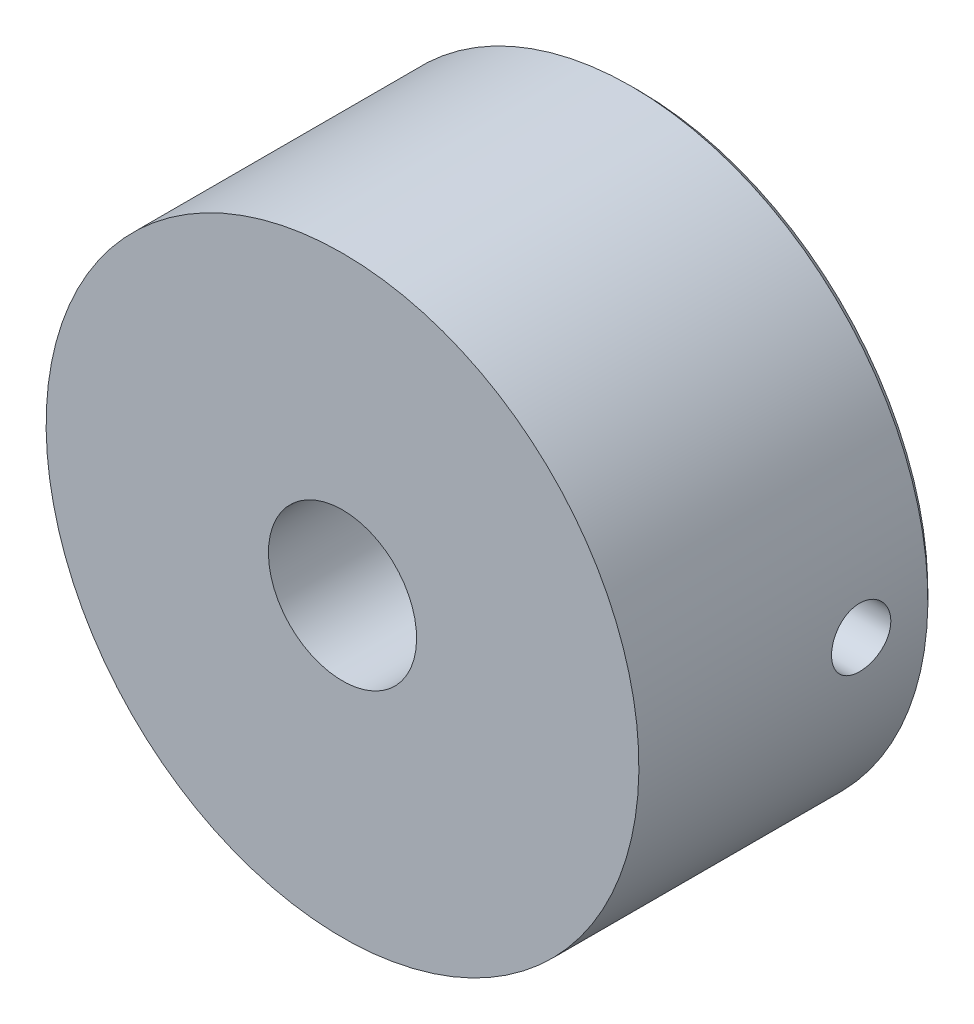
ISO-10303-21;
HEADER;
FILE_DESCRIPTION(('STEP AP214'),'2;1');
FILE_NAME('part.step','',(''),(''),'','','');
FILE_SCHEMA(('AUTOMOTIVE_DESIGN { 1 0 10303 214 1 1 1 1 }'));
ENDSEC;
DATA;
#1=APPLICATION_CONTEXT('core data for automotive mechanical design processes');
#2=APPLICATION_PROTOCOL_DEFINITION('international standard','automotive_design',2000,#1);
#3=PRODUCT_CONTEXT('',#1,'mechanical');
#4=PRODUCT('Part','Part','',(#3));
#5=PRODUCT_RELATED_PRODUCT_CATEGORY('part','',(#4));
#6=PRODUCT_DEFINITION_FORMATION('','',#4);
#7=PRODUCT_DEFINITION_CONTEXT('part definition',#1,'design');
#8=PRODUCT_DEFINITION('design','',#6,#7);
#9=PRODUCT_DEFINITION_SHAPE('','',#8);
#10=(LENGTH_UNIT() NAMED_UNIT(*) SI_UNIT(.MILLI.,.METRE.));
#11=(NAMED_UNIT(*) PLANE_ANGLE_UNIT() SI_UNIT($,.RADIAN.));
#12=(NAMED_UNIT(*) SI_UNIT($,.STERADIAN.) SOLID_ANGLE_UNIT());
#13=UNCERTAINTY_MEASURE_WITH_UNIT(LENGTH_MEASURE(1.E-05),#10,'distance_accuracy_value','');
#14=(GEOMETRIC_REPRESENTATION_CONTEXT(3) GLOBAL_UNCERTAINTY_ASSIGNED_CONTEXT((#13)) GLOBAL_UNIT_ASSIGNED_CONTEXT((#10,
#11,#12)) REPRESENTATION_CONTEXT('',''));
#15=CARTESIAN_POINT('',(0.,0.,0.));
#16=DIRECTION('',(0.,0.,1.));
#17=DIRECTION('',(1.,0.,0.));
#18=AXIS2_PLACEMENT_3D('',#15,#16,#17);
#19=CARTESIAN_POINT('',(0.,0.,20.));
#20=DIRECTION('',(0.,0.,1.));
#21=DIRECTION('',(0.,1.,0.));
#22=AXIS2_PLACEMENT_3D('',#19,#20,#21);
#23=PLANE('',#22);
#24=CARTESIAN_POINT('',(0.,0.,20.));
#25=DIRECTION('',(0.,0.,1.));
#26=DIRECTION('',(0.,1.,0.));
#27=AXIS2_PLACEMENT_3D('',#24,#25,#26);
#28=CIRCLE('',#27,20.);
#29=CARTESIAN_POINT('',(0.,20.,20.));
#30=VERTEX_POINT('',#29);
#31=EDGE_CURVE('E23',#30,#30,#28,.T.);
#32=ORIENTED_EDGE('',*,*,#31,.T.);
#33=EDGE_LOOP('',(#32));
#34=FACE_BOUND('',#33,.T.);
#35=CARTESIAN_POINT('',(0.,0.,20.));
#36=DIRECTION('',(0.,0.,1.));
#37=DIRECTION('',(0.,1.,0.));
#38=AXIS2_PLACEMENT_3D('',#35,#36,#37);
#39=CIRCLE('',#38,5.);
#40=CARTESIAN_POINT('',(0.,5.,20.));
#41=VERTEX_POINT('',#40);
#42=EDGE_CURVE('E27',#41,#41,#39,.T.);
#43=ORIENTED_EDGE('',*,*,#42,.F.);
#44=EDGE_LOOP('',(#43));
#45=FACE_BOUND('',#44,.T.);
#46=ADVANCED_FACE('F12',(#34,#45),#23,.T.);
#47=CARTESIAN_POINT('',(0.,0.,0.));
#48=DIRECTION('',(0.,0.,1.));
#49=DIRECTION('',(0.,1.,0.));
#50=AXIS2_PLACEMENT_3D('',#47,#48,#49);
#51=PLANE('',#50);
#52=CARTESIAN_POINT('',(0.,0.,0.));
#53=DIRECTION('',(0.,0.,1.));
#54=DIRECTION('',(0.,1.,0.));
#55=AXIS2_PLACEMENT_3D('',#52,#53,#54);
#56=CIRCLE('',#55,19.5);
#57=CARTESIAN_POINT('',(0.,19.5,0.));
#58=VERTEX_POINT('',#57);
#59=EDGE_CURVE('E8',#58,#58,#56,.F.);
#60=ORIENTED_EDGE('',*,*,#59,.T.);
#61=EDGE_LOOP('',(#60));
#62=FACE_BOUND('',#61,.T.);
#63=CARTESIAN_POINT('',(0.,0.,0.));
#64=DIRECTION('',(0.,0.,1.));
#65=DIRECTION('',(0.,1.,0.));
#66=AXIS2_PLACEMENT_3D('',#63,#64,#65);
#67=CIRCLE('',#66,5.);
#68=CARTESIAN_POINT('',(0.,5.,0.));
#69=VERTEX_POINT('',#68);
#70=EDGE_CURVE('E32',#69,#69,#67,.T.);
#71=ORIENTED_EDGE('',*,*,#70,.T.);
#72=EDGE_LOOP('',(#71));
#73=FACE_BOUND('',#72,.T.);
#74=ADVANCED_FACE('F64',(#62,#73),#51,.F.);
#75=CARTESIAN_POINT('',(0.,0.,20.));
#76=DIRECTION('',(0.,0.,-1.));
#77=DIRECTION('',(0.,-1.,0.));
#78=AXIS2_PLACEMENT_3D('',#75,#76,#77);
#79=CYLINDRICAL_SURFACE('',#78,20.);
#80=CARTESIAN_POINT('',(20.,0.,7.));
#81=CARTESIAN_POINT('',(19.9999987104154,-0.112040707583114,6.99999514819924));
#82=CARTESIAN_POINT('',(19.9990485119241,-0.224155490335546,6.99055346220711));
#83=CARTESIAN_POINT('',(19.9953493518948,-0.445276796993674,6.95303125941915));
#84=CARTESIAN_POINT('',(19.9925984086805,-0.554279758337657,6.92493020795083));
#85=CARTESIAN_POINT('',(19.9856082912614,-0.765943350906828,6.85091551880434));
#86=CARTESIAN_POINT('',(19.9813700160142,-0.868607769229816,6.80501263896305));
#87=CARTESIAN_POINT('',(19.9718791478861,-1.06475232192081,6.69671818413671));
#88=CARTESIAN_POINT('',(19.9666267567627,-1.15823427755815,6.63432988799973));
#89=CARTESIAN_POINT('',(19.9556748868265,-1.33371910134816,6.49459460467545));
#90=CARTESIAN_POINT('',(19.9499740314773,-1.41568428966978,6.41720040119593));
#91=CARTESIAN_POINT('',(19.9387791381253,-1.56548504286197,6.24975093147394));
#92=CARTESIAN_POINT('',(19.9332851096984,-1.63331995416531,6.15969507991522));
#93=CARTESIAN_POINT('',(19.9231118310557,-1.75306794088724,5.96924293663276));
#94=CARTESIAN_POINT('',(19.9184343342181,-1.80494693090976,5.86882511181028));
#95=CARTESIAN_POINT('',(19.9104407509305,-1.89109276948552,5.66064882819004));
#96=CARTESIAN_POINT('',(19.9071246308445,-1.92536005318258,5.5528905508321));
#97=CARTESIAN_POINT('',(19.9022416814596,-1.97519808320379,5.33347639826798));
#98=CARTESIAN_POINT('',(19.9006690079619,-1.99083130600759,5.22183484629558));
#99=CARTESIAN_POINT('',(19.8994328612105,-2.00315057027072,4.99750227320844));
#100=CARTESIAN_POINT('',(19.8997693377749,-1.99983710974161,4.88481127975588));
#101=CARTESIAN_POINT('',(19.9023081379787,-1.97440856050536,4.66200938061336));
#102=CARTESIAN_POINT('',(19.904503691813,-1.95236168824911,4.55189060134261));
#103=CARTESIAN_POINT('',(19.9105026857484,-1.89019828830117,4.33692407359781));
#104=CARTESIAN_POINT('',(19.9143061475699,-1.85008151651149,4.23207639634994));
#105=CARTESIAN_POINT('',(19.9231001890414,-1.75284178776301,4.03041282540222));
#106=CARTESIAN_POINT('',(19.9280928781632,-1.69568856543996,3.93361162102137));
#107=CARTESIAN_POINT('',(19.9387010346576,-1.56602005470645,3.75094957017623));
#108=CARTESIAN_POINT('',(19.9443165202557,-1.49350431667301,3.66508904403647));
#109=CARTESIAN_POINT('',(19.9555677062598,-1.33478822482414,3.50634921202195));
#110=CARTESIAN_POINT('',(19.9612033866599,-1.24852895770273,3.43352879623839));
#111=CARTESIAN_POINT('',(19.9718365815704,-1.06497896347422,3.30339273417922));
#112=CARTESIAN_POINT('',(19.9768340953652,-0.967688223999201,3.24607710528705));
#113=CARTESIAN_POINT('',(19.985629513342,-0.764796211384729,3.14857995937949));
#114=CARTESIAN_POINT('',(19.9894272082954,-0.659193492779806,3.10840143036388));
#115=CARTESIAN_POINT('',(19.9953929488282,-0.442694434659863,3.0463621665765));
#116=CARTESIAN_POINT('',(19.9975610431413,-0.3317982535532,3.02450088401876));
#117=CARTESIAN_POINT('',(20.0000170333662,-0.108370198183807,2.99979138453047));
#118=CARTESIAN_POINT('',(20.0003129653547,0.00415260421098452,2.996861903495));
#119=CARTESIAN_POINT('',(19.9990128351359,0.2280875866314,3.00988572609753));
#120=CARTESIAN_POINT('',(19.9974167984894,0.33949978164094,3.02583877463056));
#121=CARTESIAN_POINT('',(19.9925172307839,0.55781641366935,3.07610739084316));
#122=CARTESIAN_POINT('',(19.9892172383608,0.664729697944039,3.11038490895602));
#123=CARTESIAN_POINT('',(19.9812799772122,0.871288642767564,3.19629034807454));
#124=CARTESIAN_POINT('',(19.9766426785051,0.970934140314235,3.2479186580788));
#125=CARTESIAN_POINT('',(19.9665295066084,1.16049636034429,3.36726167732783));
#126=CARTESIAN_POINT('',(19.9610508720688,1.25037931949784,3.43502977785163));
#127=CARTESIAN_POINT('',(19.9498786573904,1.41752324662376,3.58465213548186));
#128=CARTESIAN_POINT('',(19.9441850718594,1.49478389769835,3.66650674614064));
#129=CARTESIAN_POINT('',(19.9332004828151,1.63477221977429,3.84233314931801));
#130=CARTESIAN_POINT('',(19.9279110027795,1.69744655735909,3.93634751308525));
#131=CARTESIAN_POINT('',(19.9183566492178,1.80611651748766,4.13361472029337));
#132=CARTESIAN_POINT('',(19.9140917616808,1.85211236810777,4.23686743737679));
#133=CARTESIAN_POINT('',(19.907078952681,1.92603041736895,4.44949747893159));
#134=CARTESIAN_POINT('',(19.9043283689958,1.95398434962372,4.55886368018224));
#135=CARTESIAN_POINT('',(19.9006473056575,1.99112801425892,4.78076639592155));
#136=CARTESIAN_POINT('',(19.8997167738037,2.00031828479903,4.89330281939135));
#137=CARTESIAN_POINT('',(19.8997822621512,1.99966627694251,5.11782137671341));
#138=CARTESIAN_POINT('',(19.9007698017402,1.98990777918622,5.22980376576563));
#139=CARTESIAN_POINT('',(19.9045420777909,1.95181090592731,5.45052983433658));
#140=CARTESIAN_POINT('',(19.9073268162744,1.92347250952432,5.55927351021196));
#141=CARTESIAN_POINT('',(19.9143773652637,1.84904337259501,5.77043469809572));
#142=CARTESIAN_POINT('',(19.9186429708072,1.80295508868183,5.87285308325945));
#143=CARTESIAN_POINT('',(19.9281750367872,1.69434310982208,6.06851378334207));
#144=CARTESIAN_POINT('',(19.933441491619,1.63181950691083,6.16175614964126));
#145=CARTESIAN_POINT('',(19.944409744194,1.49179711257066,6.33684734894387));
#146=CARTESIAN_POINT('',(19.950113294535,1.41423589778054,6.41864615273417));
#147=CARTESIAN_POINT('',(19.9612970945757,1.24646339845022,6.56810446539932));
#148=CARTESIAN_POINT('',(19.9667772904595,1.15624908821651,6.63576058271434));
#149=CARTESIAN_POINT('',(19.9769112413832,0.965482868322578,6.75514690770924));
#150=CARTESIAN_POINT('',(19.9815628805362,0.864905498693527,6.80683658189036));
#151=CARTESIAN_POINT('',(19.9894925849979,0.656516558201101,6.89252484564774));
#152=CARTESIAN_POINT('',(19.9927721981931,0.548713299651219,6.9265433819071));
#153=CARTESIAN_POINT('',(19.9967642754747,0.366916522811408,6.96744123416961));
#154=CARTESIAN_POINT('',(19.9979720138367,0.294085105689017,6.97963408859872));
#155=CARTESIAN_POINT('',(19.9995902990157,0.147513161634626,6.99591505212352));
#156=CARTESIAN_POINT('',(20.0000008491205,0.0737726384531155,7.00000319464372));
#157=CARTESIAN_POINT('',(20.,0.,7.));
#158=B_SPLINE_CURVE_WITH_KNOTS('',3,(#80,#81,#82,#83,#84,#85,#86,#87,#88,#89,#90,#91,#92,#93,
#94,#95,#96,#97,#98,#99,#100,#101,#102,#103,#104,#105,#106,#107,#108,#109,#110,#111,#112,#113,
#114,#115,#116,#117,#118,#119,#120,#121,#122,#123,#124,#125,#126,#127,#128,#129,#130,#131,#132,
#133,#134,#135,#136,#137,#138,#139,#140,#141,#142,#143,#144,#145,#146,#147,#148,#149,#150,#151,
#152,#153,#154,#155,#156,#157),.UNSPECIFIED.,.T.,.F.,(4,2,2,2,2,2,2,2,2,2,2,2,2,2,2,2,2,2,2,2,2,
2,2,2,2,2,2,2,2,2,2,2,2,2,2,2,2,2,4),(0.,0.335852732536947,0.672075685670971,1.0080957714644,
1.34404907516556,1.68107713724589,2.01812078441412,2.35587950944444,2.69362988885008,
3.03024464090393,3.36685054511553,3.70223594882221,4.03762588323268,4.3736152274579,
4.70961440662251,5.04709468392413,5.38457533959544,5.72211481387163,6.05964419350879,
6.39572377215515,6.73179881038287,7.0671787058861,7.40256612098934,7.73907881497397,
8.0755999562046,8.41333287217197,8.75106116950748,9.08819381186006,9.42531678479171,
9.76095258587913,10.0965887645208,10.432178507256,10.7677663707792,11.1047783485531,
11.4418710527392,11.7798126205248,12.1173718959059,12.338513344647,12.5596538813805),.UNSPECIFIED.);
#159=CARTESIAN_POINT('',(20.,0.,7.));
#160=VERTEX_POINT('',#159);
#161=EDGE_CURVE('E35',#160,#160,#158,.T.);
#162=ORIENTED_EDGE('',*,*,#161,.F.);
#163=EDGE_LOOP('',(#162));
#164=FACE_BOUND('',#163,.T.);
#165=CARTESIAN_POINT('',(0.,0.,0.5));
#166=DIRECTION('',(0.,0.,1.));
#167=DIRECTION('',(0.,1.,0.));
#168=AXIS2_PLACEMENT_3D('',#165,#166,#167);
#169=CIRCLE('',#168,20.);
#170=CARTESIAN_POINT('',(0.,20.,0.5));
#171=VERTEX_POINT('',#170);
#172=EDGE_CURVE('E19',#171,#171,#169,.T.);
#173=ORIENTED_EDGE('',*,*,#172,.T.);
#174=EDGE_LOOP('',(#173));
#175=FACE_BOUND('',#174,.T.);
#176=ORIENTED_EDGE('',*,*,#31,.F.);
#177=EDGE_LOOP('',(#176));
#178=FACE_BOUND('',#177,.T.);
#179=ADVANCED_FACE('F14',(#164,#175,#178),#79,.T.);
#180=CARTESIAN_POINT('',(0.,0.,20.));
#181=DIRECTION('',(0.,0.,-1.));
#182=DIRECTION('',(0.,-1.,0.));
#183=AXIS2_PLACEMENT_3D('',#180,#181,#182);
#184=CYLINDRICAL_SURFACE('',#183,5.);
#185=CARTESIAN_POINT('',(5.,0.,7.));
#186=CARTESIAN_POINT('',(4.99999271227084,-0.107493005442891,6.99999014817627));
#187=CARTESIAN_POINT('',(4.99649294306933,-0.215172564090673,6.99128224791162));
#188=CARTESIAN_POINT('',(4.98283453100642,-0.427496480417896,6.95675229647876));
#189=CARTESIAN_POINT('',(4.97265778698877,-0.532131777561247,6.93088372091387));
#190=CARTESIAN_POINT('',(4.94674209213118,-0.734953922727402,6.86312392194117));
#191=CARTESIAN_POINT('',(4.93102136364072,-0.833160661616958,6.82128515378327));
#192=CARTESIAN_POINT('',(4.89556610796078,-1.02107197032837,6.72298082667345));
#193=CARTESIAN_POINT('',(4.87583297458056,-1.11077947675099,6.66652034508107));
#194=CARTESIAN_POINT('',(4.83330886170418,-1.28350100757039,6.53776450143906));
#195=CARTESIAN_POINT('',(4.8104229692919,-1.36606227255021,6.46489334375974));
#196=CARTESIAN_POINT('',(4.76460576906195,-1.51817500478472,6.30659999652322));
#197=CARTESIAN_POINT('',(4.74167444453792,-1.58772010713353,6.22117170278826));
#198=CARTESIAN_POINT('',(4.69722791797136,-1.71487456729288,6.03557192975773));
#199=CARTESIAN_POINT('',(4.67582115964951,-1.77181498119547,5.9349135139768));
#200=CARTESIAN_POINT('',(4.63833647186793,-1.86775471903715,5.72446360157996));
#201=CARTESIAN_POINT('',(4.62225601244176,-1.90676256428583,5.61467647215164));
#202=CARTESIAN_POINT('',(4.59826357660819,-1.96389882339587,5.3942876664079));
#203=CARTESIAN_POINT('',(4.59001420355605,-1.98289396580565,5.28394876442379));
#204=CARTESIAN_POINT('',(4.58164004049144,-2.00217296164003,5.06136500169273));
#205=CARTESIAN_POINT('',(4.58151125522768,-2.00246601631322,4.94912110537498));
#206=CARTESIAN_POINT('',(4.58910500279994,-1.98498936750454,4.73424332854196));
#207=CARTESIAN_POINT('',(4.5962817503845,-1.96847531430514,4.63148428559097));
#208=CARTESIAN_POINT('',(4.61676187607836,-1.91994688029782,4.43034044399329));
#209=CARTESIAN_POINT('',(4.63006632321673,-1.88792979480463,4.33195641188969));
#210=CARTESIAN_POINT('',(4.6615948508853,-1.80869473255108,4.13998216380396));
#211=CARTESIAN_POINT('',(4.67991379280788,-1.76117986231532,4.04653076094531));
#212=CARTESIAN_POINT('',(4.7193811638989,-1.65250646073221,3.86858418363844));
#213=CARTESIAN_POINT('',(4.74053065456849,-1.59134280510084,3.7840923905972));
#214=CARTESIAN_POINT('',(4.78526736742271,-1.45155059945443,3.61959027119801));
#215=CARTESIAN_POINT('',(4.80891664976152,-1.37193746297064,3.54043127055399));
#216=CARTESIAN_POINT('',(4.85459824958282,-1.20031442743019,3.39631552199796));
#217=CARTESIAN_POINT('',(4.87663024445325,-1.10830206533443,3.33136160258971));
#218=CARTESIAN_POINT('',(4.91714681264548,-0.912077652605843,3.21638255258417));
#219=CARTESIAN_POINT('',(4.93555270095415,-0.807660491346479,3.16667771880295));
#220=CARTESIAN_POINT('',(4.96614828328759,-0.591023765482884,3.08583213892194));
#221=CARTESIAN_POINT('',(4.97834113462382,-0.478808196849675,3.05468196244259));
#222=CARTESIAN_POINT('',(4.9945613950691,-0.256895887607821,3.0135517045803));
#223=CARTESIAN_POINT('',(4.99902945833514,-0.147443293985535,3.00242754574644));
#224=CARTESIAN_POINT('',(5.00068478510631,0.0718453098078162,2.99828689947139));
#225=CARTESIAN_POINT('',(4.99787393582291,0.181681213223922,3.00526571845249));
#226=CARTESIAN_POINT('',(4.98557567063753,0.393432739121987,3.03629175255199));
#227=CARTESIAN_POINT('',(4.97639391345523,0.495482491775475,3.05955798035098));
#228=CARTESIAN_POINT('',(4.952594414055,0.69413542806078,3.12143570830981));
#229=CARTESIAN_POINT('',(4.9379759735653,0.790737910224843,3.16004917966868));
#230=CARTESIAN_POINT('',(4.90416594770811,0.9790787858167,3.25278493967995));
#231=CARTESIAN_POINT('',(4.88484815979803,1.07057802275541,3.30734547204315));
#232=CARTESIAN_POINT('',(4.84373364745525,1.24344359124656,3.42994032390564));
#233=CARTESIAN_POINT('',(4.8219359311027,1.32480584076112,3.49798004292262));
#234=CARTESIAN_POINT('',(4.77645117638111,1.48072304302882,3.65087001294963));
#235=CARTESIAN_POINT('',(4.75273441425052,1.55447393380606,3.73653354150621));
#236=CARTESIAN_POINT('',(4.70741672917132,1.68675119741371,3.91944008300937));
#237=CARTESIAN_POINT('',(4.68581615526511,1.74527506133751,4.01668500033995));
#238=CARTESIAN_POINT('',(4.64714299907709,1.84580750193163,4.2214616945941));
#239=CARTESIAN_POINT('',(4.63011630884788,1.88765059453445,4.32908399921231));
#240=CARTESIAN_POINT('',(4.60323673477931,1.9522962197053,4.55073365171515));
#241=CARTESIAN_POINT('',(4.59337855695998,1.97511280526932,4.66475620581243));
#242=CARTESIAN_POINT('',(4.58271759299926,1.9997156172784,4.88712790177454));
#243=CARTESIAN_POINT('',(4.58131421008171,2.00289708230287,4.99529483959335));
#244=CARTESIAN_POINT('',(4.58614836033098,1.99180315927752,5.2105448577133));
#245=CARTESIAN_POINT('',(4.59238492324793,1.97752998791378,5.31762807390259));
#246=CARTESIAN_POINT('',(4.61126649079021,1.93307136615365,5.52333218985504));
#247=CARTESIAN_POINT('',(4.62364831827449,1.90353749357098,5.622120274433));
#248=CARTESIAN_POINT('',(4.65324001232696,1.83000544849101,5.81337862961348));
#249=CARTESIAN_POINT('',(4.67045121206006,1.78600328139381,5.90584714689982));
#250=CARTESIAN_POINT('',(4.70898609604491,1.68187276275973,6.08760961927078));
#251=CARTESIAN_POINT('',(4.73048882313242,1.62096533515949,6.17641867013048));
#252=CARTESIAN_POINT('',(4.77463804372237,1.4858921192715,6.34299331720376));
#253=CARTESIAN_POINT('',(4.79728488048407,1.41172233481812,6.42075557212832));
#254=CARTESIAN_POINT('',(4.84293567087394,1.24650550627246,6.56820285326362));
#255=CARTESIAN_POINT('',(4.86586757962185,1.15467600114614,6.63703730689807));
#256=CARTESIAN_POINT('',(4.90800406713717,0.959900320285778,6.75833704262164));
#257=CARTESIAN_POINT('',(4.92720691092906,0.856949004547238,6.81079471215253));
#258=CARTESIAN_POINT('',(4.95939714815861,0.644738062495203,6.89662221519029));
#259=CARTESIAN_POINT('',(4.97249363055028,0.535631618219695,6.93032932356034));
#260=CARTESIAN_POINT('',(4.99144306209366,0.31287654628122,6.97863912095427));
#261=CARTESIAN_POINT('',(4.99731899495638,0.199243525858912,6.9933024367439));
#262=CARTESIAN_POINT('',(4.99975899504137,0.0569122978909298,6.99939538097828));
#263=CARTESIAN_POINT('',(5.00000192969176,0.0284626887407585,7.0000026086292));
#264=CARTESIAN_POINT('',(5.,0.,7.));
#265=B_SPLINE_CURVE_WITH_KNOTS('',3,(#185,#186,#187,#188,#189,#190,#191,#192,#193,#194,#195,
#196,#197,#198,#199,#200,#201,#202,#203,#204,#205,#206,#207,#208,#209,#210,#211,#212,#213,#214,
#215,#216,#217,#218,#219,#220,#221,#222,#223,#224,#225,#226,#227,#228,#229,#230,#231,#232,#233,
#234,#235,#236,#237,#238,#239,#240,#241,#242,#243,#244,#245,#246,#247,#248,#249,#250,#251,#252,
#253,#254,#255,#256,#257,#258,#259,#260,#261,#262,#263,#264),.UNSPECIFIED.,.T.,.F.,(4,2,2,2,2,2,
2,2,2,2,2,2,2,2,2,2,2,2,2,2,2,2,2,2,2,2,2,2,2,2,2,2,2,2,2,2,2,2,2,4),(0.,0.322402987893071,
0.645683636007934,0.96791145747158,1.29002753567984,1.62597381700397,1.96208394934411,
2.31315258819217,2.66405423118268,2.99904105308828,3.33386306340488,3.64538328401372,
3.95695787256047,4.27489126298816,4.59294421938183,4.93558349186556,5.27829092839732,
5.62776913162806,5.9770695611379,6.30569184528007,6.63422893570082,6.94800455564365,
7.26182048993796,7.58523513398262,7.90877959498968,8.25368474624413,8.59864669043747,
8.94695045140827,9.29499672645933,9.61799673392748,9.94095572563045,10.2511431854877,
10.5614163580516,10.8894546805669,11.2175920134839,11.5670042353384,11.9165786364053,
12.2596430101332,12.6016125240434,12.686980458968),.UNSPECIFIED.);
#266=CARTESIAN_POINT('',(5.,0.,7.));
#267=VERTEX_POINT('',#266);
#268=EDGE_CURVE('E43',#267,#267,#265,.T.);
#269=ORIENTED_EDGE('',*,*,#268,.T.);
#270=EDGE_LOOP('',(#269));
#271=FACE_BOUND('',#270,.T.);
#272=ORIENTED_EDGE('',*,*,#42,.T.);
#273=EDGE_LOOP('',(#272));
#274=FACE_BOUND('',#273,.T.);
#275=ORIENTED_EDGE('',*,*,#70,.F.);
#276=EDGE_LOOP('',(#275));
#277=FACE_BOUND('',#276,.T.);
#278=ADVANCED_FACE('F59',(#271,#274,#277),#184,.F.);
#279=CARTESIAN_POINT('',(0.,0.,0.5));
#280=DIRECTION('',(0.,0.,1.));
#281=DIRECTION('',(0.,1.,0.));
#282=AXIS2_PLACEMENT_3D('',#279,#280,#281);
#283=CONICAL_SURFACE('',#282,20.,0.785398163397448);
#284=ORIENTED_EDGE('',*,*,#59,.F.);
#285=EDGE_LOOP('',(#284));
#286=FACE_BOUND('',#285,.T.);
#287=ORIENTED_EDGE('',*,*,#172,.F.);
#288=EDGE_LOOP('',(#287));
#289=FACE_BOUND('',#288,.T.);
#290=ADVANCED_FACE('F54',(#286,#289),#283,.T.);
#291=CARTESIAN_POINT('',(20.001,0.,5.));
#292=DIRECTION('',(-1.,0.,0.));
#293=DIRECTION('',(0.,0.,1.));
#294=AXIS2_PLACEMENT_3D('',#291,#292,#293);
#295=CYLINDRICAL_SURFACE('',#294,2.);
#296=ORIENTED_EDGE('',*,*,#268,.F.);
#297=EDGE_LOOP('',(#296));
#298=FACE_BOUND('',#297,.T.);
#299=ORIENTED_EDGE('',*,*,#161,.T.);
#300=EDGE_LOOP('',(#299));
#301=FACE_BOUND('',#300,.T.);
#302=ADVANCED_FACE('F48',(#298,#301),#295,.F.);
#303=CLOSED_SHELL('',(#46,#74,#179,#278,#290,#302));
#304=MANIFOLD_SOLID_BREP('B1',#303);
#305=ADVANCED_BREP_SHAPE_REPRESENTATION('',(#18,#304),#14);
#306=SHAPE_DEFINITION_REPRESENTATION(#9,#305);
ENDSEC;
END-ISO-10303-21;
